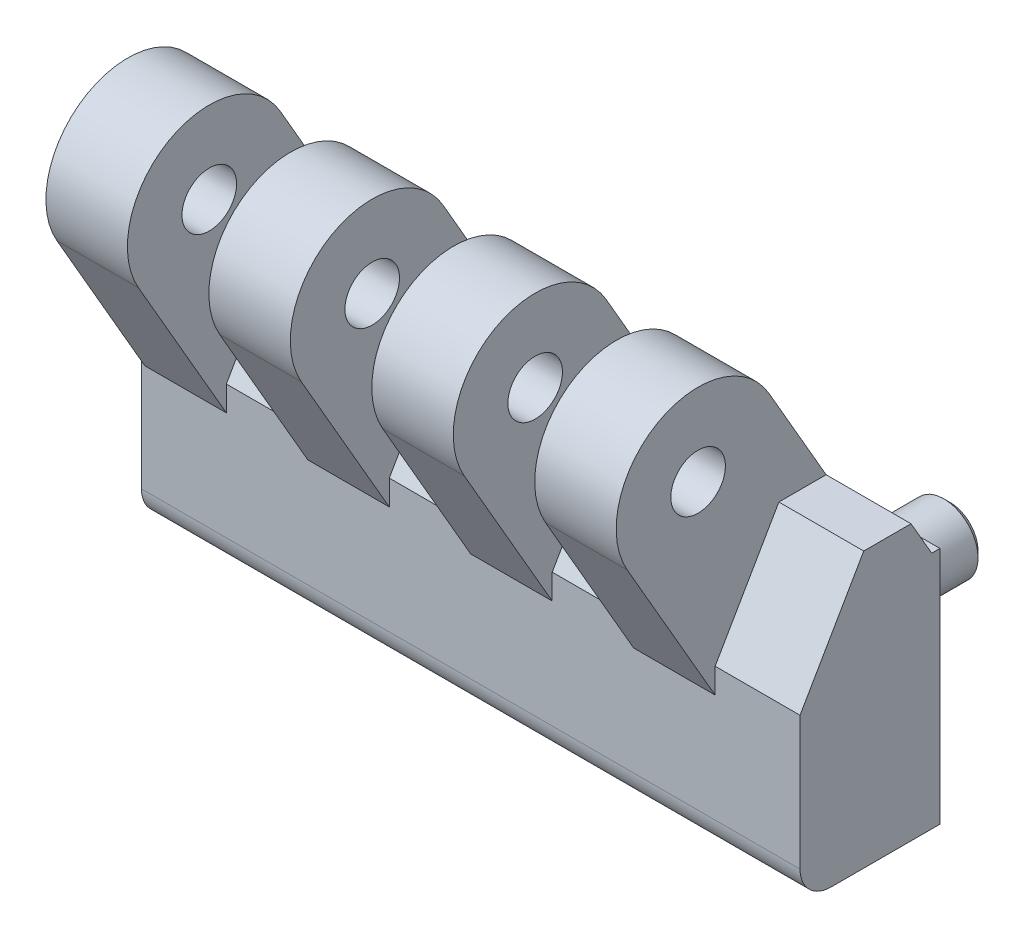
ISO-10303-21;
HEADER;
FILE_DESCRIPTION(('STEP AP214'),'2;1');
FILE_NAME('part.step','',(''),(''),'','','');
FILE_SCHEMA(('AUTOMOTIVE_DESIGN { 1 0 10303 214 1 1 1 1 }'));
ENDSEC;
DATA;
#1=APPLICATION_CONTEXT('core data for automotive mechanical design processes');
#2=APPLICATION_PROTOCOL_DEFINITION('international standard','automotive_design',2000,#1);
#3=PRODUCT_CONTEXT('',#1,'mechanical');
#4=PRODUCT('Part','Part','',(#3));
#5=PRODUCT_RELATED_PRODUCT_CATEGORY('part','',(#4));
#6=PRODUCT_DEFINITION_FORMATION('','',#4);
#7=PRODUCT_DEFINITION_CONTEXT('part definition',#1,'design');
#8=PRODUCT_DEFINITION('design','',#6,#7);
#9=PRODUCT_DEFINITION_SHAPE('','',#8);
#10=(LENGTH_UNIT() NAMED_UNIT(*) SI_UNIT(.MILLI.,.METRE.));
#11=(NAMED_UNIT(*) PLANE_ANGLE_UNIT() SI_UNIT($,.RADIAN.));
#12=(NAMED_UNIT(*) SI_UNIT($,.STERADIAN.) SOLID_ANGLE_UNIT());
#13=UNCERTAINTY_MEASURE_WITH_UNIT(LENGTH_MEASURE(1.E-05),#10,'distance_accuracy_value','');
#14=(GEOMETRIC_REPRESENTATION_CONTEXT(3) GLOBAL_UNCERTAINTY_ASSIGNED_CONTEXT((#13)) GLOBAL_UNIT_ASSIGNED_CONTEXT((#10,
#11,#12)) REPRESENTATION_CONTEXT('',''));
#15=CARTESIAN_POINT('',(0.,0.,0.));
#16=DIRECTION('',(0.,0.,1.));
#17=DIRECTION('',(1.,0.,0.));
#18=AXIS2_PLACEMENT_3D('',#15,#16,#17);
#19=CARTESIAN_POINT('',(-18.5,22.75,4.2361162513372));
#20=DIRECTION('',(0.,1.,0.));
#21=DIRECTION('',(-1.,0.,0.));
#22=AXIS2_PLACEMENT_3D('',#19,#20,#21);
#23=PLANE('',#22);
#24=DIRECTION('',(1.,0.,0.));
#25=VECTOR('',#24,1.);
#26=CARTESIAN_POINT('',(-18.5,22.75,11.164319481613));
#27=LINE('',#26,#25);
#28=CARTESIAN_POINT('',(41.6875,22.75,11.164319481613));
#29=VERTEX_POINT('',#28);
#30=CARTESIAN_POINT('',(53.625,22.75,11.164319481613));
#31=VERTEX_POINT('',#30);
#32=EDGE_CURVE('E471',#29,#31,#27,.T.);
#33=ORIENTED_EDGE('',*,*,#32,.T.);
#34=DIRECTION('',(0.,0.,-1.));
#35=VECTOR('',#34,1.);
#36=CARTESIAN_POINT('',(53.625,22.75,4.2361162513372));
#37=LINE('',#36,#35);
#38=CARTESIAN_POINT('',(53.625,22.75,4.23611625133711));
#39=VERTEX_POINT('',#38);
#40=EDGE_CURVE('E29',#31,#39,#37,.T.);
#41=ORIENTED_EDGE('',*,*,#40,.T.);
#42=DIRECTION('',(1.,0.,0.));
#43=VECTOR('',#42,1.);
#44=CARTESIAN_POINT('',(-18.5,22.75,4.2361162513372));
#45=LINE('',#44,#43);
#46=CARTESIAN_POINT('',(41.6875,22.75,4.23611625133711));
#47=VERTEX_POINT('',#46);
#48=EDGE_CURVE('E232',#47,#39,#45,.T.);
#49=ORIENTED_EDGE('',*,*,#48,.F.);
#50=DIRECTION('',(0.,0.,-1.));
#51=VECTOR('',#50,1.);
#52=CARTESIAN_POINT('',(41.6875,22.75,4.2361162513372));
#53=LINE('',#52,#51);
#54=EDGE_CURVE('E405',#29,#47,#53,.T.);
#55=ORIENTED_EDGE('',*,*,#54,.F.);
#56=EDGE_LOOP('',(#33,#41,#49,#55));
#57=FACE_BOUND('',#56,.T.);
#58=ADVANCED_FACE('F14',(#57),#23,.T.);
#59=CARTESIAN_POINT('',(-18.5,22.75,11.164319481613));
#60=DIRECTION('',(0.,0.499999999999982,0.866025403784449));
#61=DIRECTION('',(0.,-0.866025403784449,0.499999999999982));
#62=AXIS2_PLACEMENT_3D('',#59,#60,#61);
#63=PLANE('',#62);
#64=DIRECTION('',(1.,0.,0.));
#65=VECTOR('',#64,1.);
#66=CARTESIAN_POINT('',(-18.5,6.580127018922,20.5));
#67=LINE('',#66,#65);
#68=CARTESIAN_POINT('',(41.6875,6.580127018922,20.5));
#69=VERTEX_POINT('',#68);
#70=CARTESIAN_POINT('',(53.625,6.580127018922,20.5));
#71=VERTEX_POINT('',#70);
#72=EDGE_CURVE('E465',#69,#71,#67,.T.);
#73=ORIENTED_EDGE('',*,*,#72,.T.);
#74=DIRECTION('',(0.,0.866025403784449,-0.499999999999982));
#75=VECTOR('',#74,1.);
#76=CARTESIAN_POINT('',(53.625,22.75,11.164319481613));
#77=LINE('',#76,#75);
#78=EDGE_CURVE('E502',#71,#31,#77,.T.);
#79=ORIENTED_EDGE('',*,*,#78,.T.);
#80=ORIENTED_EDGE('',*,*,#32,.F.);
#81=DIRECTION('',(0.,0.866025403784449,-0.499999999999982));
#82=VECTOR('',#81,1.);
#83=CARTESIAN_POINT('',(41.6875,22.75,11.164319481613));
#84=LINE('',#83,#82);
#85=EDGE_CURVE('E403',#69,#29,#84,.T.);
#86=ORIENTED_EDGE('',*,*,#85,.F.);
#87=EDGE_LOOP('',(#73,#79,#80,#86));
#88=FACE_BOUND('',#87,.T.);
#89=ADVANCED_FACE('F630',(#88),#63,.T.);
#90=CARTESIAN_POINT('',(-18.5,22.75,11.164319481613));
#91=VERTEX_POINT('',#90);
#92=CARTESIAN_POINT('',(-18.,22.75,11.164319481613));
#93=VERTEX_POINT('',#92);
#94=EDGE_CURVE('E466',#91,#93,#27,.T.);
#95=ORIENTED_EDGE('',*,*,#94,.T.);
#96=DIRECTION('',(0.,0.,-1.));
#97=VECTOR('',#96,1.);
#98=CARTESIAN_POINT('',(-18.,22.75,4.2361162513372));
#99=LINE('',#98,#97);
#100=CARTESIAN_POINT('',(-18.,22.75,4.2361162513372));
#101=VERTEX_POINT('',#100);
#102=EDGE_CURVE('E322',#93,#101,#99,.T.);
#103=ORIENTED_EDGE('',*,*,#102,.T.);
#104=CARTESIAN_POINT('',(-18.5,22.75,4.2361162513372));
#105=VERTEX_POINT('',#104);
#106=EDGE_CURVE('E472',#105,#101,#45,.T.);
#107=ORIENTED_EDGE('',*,*,#106,.F.);
#108=DIRECTION('',(0.,0.,1.));
#109=VECTOR('',#108,1.);
#110=CARTESIAN_POINT('',(-18.5,22.75,4.2361162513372));
#111=LINE('',#110,#109);
#112=EDGE_CURVE('E441',#105,#91,#111,.T.);
#113=ORIENTED_EDGE('',*,*,#112,.T.);
#114=EDGE_LOOP('',(#95,#103,#107,#113));
#115=FACE_BOUND('',#114,.T.);
#116=ADVANCED_FACE('F574',(#115),#23,.T.);
#117=CARTESIAN_POINT('',(-18.5,6.580127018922,20.5));
#118=VERTEX_POINT('',#117);
#119=CARTESIAN_POINT('',(-18.,6.580127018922,20.5));
#120=VERTEX_POINT('',#119);
#121=EDGE_CURVE('E460',#118,#120,#67,.T.);
#122=ORIENTED_EDGE('',*,*,#121,.T.);
#123=DIRECTION('',(0.,0.866025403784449,-0.499999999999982));
#124=VECTOR('',#123,1.);
#125=CARTESIAN_POINT('',(-18.,22.75,11.164319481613));
#126=LINE('',#125,#124);
#127=EDGE_CURVE('E320',#120,#93,#126,.T.);
#128=ORIENTED_EDGE('',*,*,#127,.T.);
#129=ORIENTED_EDGE('',*,*,#94,.F.);
#130=DIRECTION('',(0.,-0.866025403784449,0.499999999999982));
#131=VECTOR('',#130,1.);
#132=CARTESIAN_POINT('',(-18.5,22.75,11.164319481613));
#133=LINE('',#132,#131);
#134=EDGE_CURVE('E444',#91,#118,#133,.T.);
#135=ORIENTED_EDGE('',*,*,#134,.T.);
#136=EDGE_LOOP('',(#122,#128,#129,#135));
#137=FACE_BOUND('',#136,.T.);
#138=ADVANCED_FACE('F638',(#137),#63,.T.);
#139=CARTESIAN_POINT('',(-18.5,6.580127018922,20.5));
#140=DIRECTION('',(0.,0.,1.));
#141=DIRECTION('',(1.,0.,0.));
#142=AXIS2_PLACEMENT_3D('',#139,#140,#141);
#143=PLANE('',#142);
#144=DIRECTION('',(0.,1.,0.));
#145=VECTOR('',#144,1.);
#146=CARTESIAN_POINT('',(65.5625,6.580127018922,20.5));
#147=LINE('',#146,#145);
#148=CARTESIAN_POINT('',(65.5625,2.919872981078,20.5));
#149=VERTEX_POINT('',#148);
#150=CARTESIAN_POINT('',(65.5625,6.580127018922,20.5));
#151=VERTEX_POINT('',#150);
#152=EDGE_CURVE('E278',#149,#151,#147,.T.);
#153=ORIENTED_EDGE('',*,*,#152,.F.);
#154=DIRECTION('',(-1.,0.,0.));
#155=VECTOR('',#154,1.);
#156=CARTESIAN_POINT('',(-18.5,2.919872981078,20.5));
#157=LINE('',#156,#155);
#158=CARTESIAN_POINT('',(53.625,2.919872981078,20.5));
#159=VERTEX_POINT('',#158);
#160=EDGE_CURVE('E506',#149,#159,#157,.T.);
#161=ORIENTED_EDGE('',*,*,#160,.T.);
#162=DIRECTION('',(0.,1.,0.));
#163=VECTOR('',#162,1.);
#164=CARTESIAN_POINT('',(53.625,6.580127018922,20.5));
#165=LINE('',#164,#163);
#166=EDGE_CURVE('E273',#159,#71,#165,.T.);
#167=ORIENTED_EDGE('',*,*,#166,.T.);
#168=ORIENTED_EDGE('',*,*,#72,.F.);
#169=DIRECTION('',(0.,1.,0.));
#170=VECTOR('',#169,1.);
#171=CARTESIAN_POINT('',(41.6875,6.580127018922,20.5));
#172=LINE('',#171,#170);
#173=CARTESIAN_POINT('',(41.6875,2.919872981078,20.5));
#174=VERTEX_POINT('',#173);
#175=EDGE_CURVE('E488',#174,#69,#172,.T.);
#176=ORIENTED_EDGE('',*,*,#175,.F.);
#177=DIRECTION('',(-1.,0.,0.));
#178=VECTOR('',#177,1.);
#179=CARTESIAN_POINT('',(-18.5,2.919872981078,20.5));
#180=LINE('',#179,#178);
#181=CARTESIAN_POINT('',(29.75,2.919872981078,20.5));
#182=VERTEX_POINT('',#181);
#183=EDGE_CURVE('E485',#174,#182,#180,.T.);
#184=ORIENTED_EDGE('',*,*,#183,.T.);
#185=DIRECTION('',(0.,1.,0.));
#186=VECTOR('',#185,1.);
#187=CARTESIAN_POINT('',(29.75,6.580127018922,20.5));
#188=LINE('',#187,#186);
#189=CARTESIAN_POINT('',(29.75,6.580127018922,20.5));
#190=VERTEX_POINT('',#189);
#191=EDGE_CURVE('E482',#182,#190,#188,.T.);
#192=ORIENTED_EDGE('',*,*,#191,.T.);
#193=CARTESIAN_POINT('',(17.8125,6.580127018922,20.5));
#194=VERTEX_POINT('',#193);
#195=EDGE_CURVE('E552',#194,#190,#67,.T.);
#196=ORIENTED_EDGE('',*,*,#195,.F.);
#197=DIRECTION('',(0.,1.,0.));
#198=VECTOR('',#197,1.);
#199=CARTESIAN_POINT('',(17.8125,6.580127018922,20.5));
#200=LINE('',#199,#198);
#201=CARTESIAN_POINT('',(17.8125,2.919872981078,20.5));
#202=VERTEX_POINT('',#201);
#203=EDGE_CURVE('E490',#202,#194,#200,.T.);
#204=ORIENTED_EDGE('',*,*,#203,.F.);
#205=DIRECTION('',(1.,0.,0.));
#206=VECTOR('',#205,1.);
#207=CARTESIAN_POINT('',(-18.5,2.919872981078,20.5));
#208=LINE('',#207,#206);
#209=CARTESIAN_POINT('',(5.875,2.919872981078,20.5));
#210=VERTEX_POINT('',#209);
#211=EDGE_CURVE('E493',#210,#202,#208,.T.);
#212=ORIENTED_EDGE('',*,*,#211,.F.);
#213=DIRECTION('',(0.,1.,0.));
#214=VECTOR('',#213,1.);
#215=CARTESIAN_POINT('',(5.875,6.580127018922,20.5));
#216=LINE('',#215,#214);
#217=CARTESIAN_POINT('',(5.875,6.580127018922,20.5));
#218=VERTEX_POINT('',#217);
#219=EDGE_CURVE('E496',#210,#218,#216,.T.);
#220=ORIENTED_EDGE('',*,*,#219,.T.);
#221=CARTESIAN_POINT('',(-6.0625,6.580127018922,20.5));
#222=VERTEX_POINT('',#221);
#223=EDGE_CURVE('E464',#222,#218,#67,.T.);
#224=ORIENTED_EDGE('',*,*,#223,.F.);
#225=DIRECTION('',(0.,1.,0.));
#226=VECTOR('',#225,1.);
#227=CARTESIAN_POINT('',(-6.0625,6.580127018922,20.5));
#228=LINE('',#227,#226);
#229=CARTESIAN_POINT('',(-6.0625,2.919872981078,20.5));
#230=VERTEX_POINT('',#229);
#231=EDGE_CURVE('E311',#230,#222,#228,.T.);
#232=ORIENTED_EDGE('',*,*,#231,.F.);
#233=DIRECTION('',(1.,0.,0.));
#234=VECTOR('',#233,1.);
#235=CARTESIAN_POINT('',(-18.5,2.919872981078,20.5));
#236=LINE('',#235,#234);
#237=CARTESIAN_POINT('',(-18.,2.919872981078,20.5));
#238=VERTEX_POINT('',#237);
#239=EDGE_CURVE('E499',#238,#230,#236,.T.);
#240=ORIENTED_EDGE('',*,*,#239,.F.);
#241=DIRECTION('',(0.,1.,0.));
#242=VECTOR('',#241,1.);
#243=CARTESIAN_POINT('',(-18.,6.580127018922,20.5));
#244=LINE('',#243,#242);
#245=EDGE_CURVE('E318',#238,#120,#244,.T.);
#246=ORIENTED_EDGE('',*,*,#245,.T.);
#247=ORIENTED_EDGE('',*,*,#121,.F.);
#248=DIRECTION('',(0.,-1.,0.));
#249=VECTOR('',#248,1.);
#250=CARTESIAN_POINT('',(-18.5,6.580127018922,20.5));
#251=LINE('',#250,#249);
#252=CARTESIAN_POINT('',(-18.5,-12.944444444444,20.5));
#253=VERTEX_POINT('',#252);
#254=EDGE_CURVE('E447',#118,#253,#251,.T.);
#255=ORIENTED_EDGE('',*,*,#254,.T.);
#256=DIRECTION('',(1.,0.,0.));
#257=VECTOR('',#256,1.);
#258=CARTESIAN_POINT('',(-18.5,-12.944444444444,20.5));
#259=LINE('',#258,#257);
#260=CARTESIAN_POINT('',(78.,-12.944444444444,20.5));
#261=VERTEX_POINT('',#260);
#262=EDGE_CURVE('E457',#253,#261,#259,.T.);
#263=ORIENTED_EDGE('',*,*,#262,.T.);
#264=DIRECTION('',(0.,-1.,0.));
#265=VECTOR('',#264,1.);
#266=CARTESIAN_POINT('',(78.,6.580127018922,20.5));
#267=LINE('',#266,#265);
#268=CARTESIAN_POINT('',(78.,6.580127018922,20.5));
#269=VERTEX_POINT('',#268);
#270=EDGE_CURVE('E423',#269,#261,#267,.T.);
#271=ORIENTED_EDGE('',*,*,#270,.F.);
#272=EDGE_CURVE('E459',#151,#269,#67,.T.);
#273=ORIENTED_EDGE('',*,*,#272,.F.);
#274=EDGE_LOOP('',(#153,#161,#167,#168,#176,#184,#192,#196,#204,#212,#220,#224,#232,#240,#246,
#247,#255,#263,#271,#273));
#275=FACE_BOUND('',#274,.T.);
#276=ADVANCED_FACE('F563',(#275),#143,.T.);
#277=DIRECTION('',(0.,0.,-1.));
#278=VECTOR('',#277,1.);
#279=CARTESIAN_POINT('',(-6.0625,22.75,4.2361162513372));
#280=LINE('',#279,#278);
#281=CARTESIAN_POINT('',(-6.0625,22.75,11.164319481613));
#282=VERTEX_POINT('',#281);
#283=CARTESIAN_POINT('',(-6.0625,22.75,4.2361162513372));
#284=VERTEX_POINT('',#283);
#285=EDGE_CURVE('E37',#282,#284,#280,.T.);
#286=ORIENTED_EDGE('',*,*,#285,.F.);
#287=CARTESIAN_POINT('',(5.875,22.75,11.164319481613));
#288=VERTEX_POINT('',#287);
#289=EDGE_CURVE('E470',#282,#288,#27,.T.);
#290=ORIENTED_EDGE('',*,*,#289,.T.);
#291=DIRECTION('',(0.,0.,-1.));
#292=VECTOR('',#291,1.);
#293=CARTESIAN_POINT('',(5.875,22.75,4.2361162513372));
#294=LINE('',#293,#292);
#295=CARTESIAN_POINT('',(5.875,22.75,4.2361162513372));
#296=VERTEX_POINT('',#295);
#297=EDGE_CURVE('E364',#288,#296,#294,.T.);
#298=ORIENTED_EDGE('',*,*,#297,.T.);
#299=EDGE_CURVE('E476',#284,#296,#45,.T.);
#300=ORIENTED_EDGE('',*,*,#299,.F.);
#301=EDGE_LOOP('',(#286,#290,#298,#300));
#302=FACE_BOUND('',#301,.T.);
#303=ADVANCED_FACE('F603',(#302),#23,.T.);
#304=DIRECTION('',(0.,0.866025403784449,-0.499999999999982));
#305=VECTOR('',#304,1.);
#306=CARTESIAN_POINT('',(-6.0625,22.75,11.164319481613));
#307=LINE('',#306,#305);
#308=EDGE_CURVE('E314',#222,#282,#307,.T.);
#309=ORIENTED_EDGE('',*,*,#308,.F.);
#310=ORIENTED_EDGE('',*,*,#223,.T.);
#311=DIRECTION('',(0.,0.866025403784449,-0.499999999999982));
#312=VECTOR('',#311,1.);
#313=CARTESIAN_POINT('',(5.875,22.75,11.164319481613));
#314=LINE('',#313,#312);
#315=EDGE_CURVE('E361',#218,#288,#314,.T.);
#316=ORIENTED_EDGE('',*,*,#315,.T.);
#317=ORIENTED_EDGE('',*,*,#289,.F.);
#318=EDGE_LOOP('',(#309,#310,#316,#317));
#319=FACE_BOUND('',#318,.T.);
#320=ADVANCED_FACE('F594',(#319),#63,.T.);
#321=DIRECTION('',(0.,0.,-1.));
#322=VECTOR('',#321,1.);
#323=CARTESIAN_POINT('',(17.8125,22.75,4.2361162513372));
#324=LINE('',#323,#322);
#325=CARTESIAN_POINT('',(17.8125,22.75,11.164319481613));
#326=VERTEX_POINT('',#325);
#327=CARTESIAN_POINT('',(17.8125,22.75,4.2361162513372));
#328=VERTEX_POINT('',#327);
#329=EDGE_CURVE('E358',#326,#328,#324,.T.);
#330=ORIENTED_EDGE('',*,*,#329,.F.);
#331=CARTESIAN_POINT('',(29.75,22.75,11.164319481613));
#332=VERTEX_POINT('',#331);
#333=EDGE_CURVE('E538',#326,#332,#27,.T.);
#334=ORIENTED_EDGE('',*,*,#333,.T.);
#335=DIRECTION('',(0.,0.,-1.));
#336=VECTOR('',#335,1.);
#337=CARTESIAN_POINT('',(29.75,22.75,4.2361162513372));
#338=LINE('',#337,#336);
#339=CARTESIAN_POINT('',(29.75,22.75,4.23611625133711));
#340=VERTEX_POINT('',#339);
#341=EDGE_CURVE('E400',#332,#340,#338,.T.);
#342=ORIENTED_EDGE('',*,*,#341,.T.);
#343=EDGE_CURVE('E604',#328,#340,#45,.T.);
#344=ORIENTED_EDGE('',*,*,#343,.F.);
#345=EDGE_LOOP('',(#330,#334,#342,#344));
#346=FACE_BOUND('',#345,.T.);
#347=ADVANCED_FACE('F542',(#346),#23,.T.);
#348=DIRECTION('',(0.,0.866025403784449,-0.499999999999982));
#349=VECTOR('',#348,1.);
#350=CARTESIAN_POINT('',(17.8125,22.75,11.164319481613));
#351=LINE('',#350,#349);
#352=EDGE_CURVE('E355',#194,#326,#351,.T.);
#353=ORIENTED_EDGE('',*,*,#352,.F.);
#354=ORIENTED_EDGE('',*,*,#195,.T.);
#355=DIRECTION('',(0.,0.866025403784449,-0.499999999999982));
#356=VECTOR('',#355,1.);
#357=CARTESIAN_POINT('',(29.75,22.75,11.164319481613));
#358=LINE('',#357,#356);
#359=EDGE_CURVE('E397',#190,#332,#358,.T.);
#360=ORIENTED_EDGE('',*,*,#359,.T.);
#361=ORIENTED_EDGE('',*,*,#333,.F.);
#362=EDGE_LOOP('',(#353,#354,#360,#361));
#363=FACE_BOUND('',#362,.T.);
#364=ADVANCED_FACE('F551',(#363),#63,.T.);
#365=CARTESIAN_POINT('',(-18.5,-17.5,15.944444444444));
#366=DIRECTION('',(0.,-1.,0.));
#367=DIRECTION('',(1.,0.,0.));
#368=AXIS2_PLACEMENT_3D('',#365,#366,#367);
#369=PLANE('',#368);
#370=DIRECTION('',(1.,0.,0.));
#371=VECTOR('',#370,1.);
#372=CARTESIAN_POINT('',(-18.5,-17.5,0.));
#373=LINE('',#372,#371);
#374=CARTESIAN_POINT('',(-18.5,-17.5,0.));
#375=VERTEX_POINT('',#374);
#376=CARTESIAN_POINT('',(78.,-17.5,0.));
#377=VERTEX_POINT('',#376);
#378=EDGE_CURVE('E480',#375,#377,#373,.T.);
#379=ORIENTED_EDGE('',*,*,#378,.T.);
#380=DIRECTION('',(0.,0.,-1.));
#381=VECTOR('',#380,1.);
#382=CARTESIAN_POINT('',(78.,-17.5,15.944444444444));
#383=LINE('',#382,#381);
#384=CARTESIAN_POINT('',(78.,-17.5,15.944444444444));
#385=VERTEX_POINT('',#384);
#386=EDGE_CURVE('E407',#385,#377,#383,.T.);
#387=ORIENTED_EDGE('',*,*,#386,.F.);
#388=DIRECTION('',(1.,0.,0.));
#389=VECTOR('',#388,1.);
#390=CARTESIAN_POINT('',(-18.5,-17.5,15.944444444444));
#391=LINE('',#390,#389);
#392=CARTESIAN_POINT('',(-18.5,-17.5,15.944444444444));
#393=VERTEX_POINT('',#392);
#394=EDGE_CURVE('E453',#393,#385,#391,.T.);
#395=ORIENTED_EDGE('',*,*,#394,.F.);
#396=DIRECTION('',(0.,0.,-1.));
#397=VECTOR('',#396,1.);
#398=CARTESIAN_POINT('',(-18.5,-17.5,15.944444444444));
#399=LINE('',#398,#397);
#400=EDGE_CURVE('E429',#393,#375,#399,.T.);
#401=ORIENTED_EDGE('',*,*,#400,.T.);
#402=EDGE_LOOP('',(#379,#387,#395,#401));
#403=FACE_BOUND('',#402,.T.);
#404=ADVANCED_FACE('F16',(#403),#369,.T.);
#405=CARTESIAN_POINT('',(-18.5,-17.5,0.));
#406=DIRECTION('',(0.,0.,-1.));
#407=DIRECTION('',(-1.,0.,0.));
#408=AXIS2_PLACEMENT_3D('',#405,#406,#407);
#409=PLANE('',#408);
#410=CARTESIAN_POINT('',(0.,0.,0.));
#411=DIRECTION('',(0.,0.,-1.));
#412=DIRECTION('',(-1.,0.,0.));
#413=AXIS2_PLACEMENT_3D('',#410,#411,#412);
#414=CIRCLE('',#413,5.);
#415=CARTESIAN_POINT('',(-5.,0.,0.));
#416=VERTEX_POINT('',#415);
#417=EDGE_CURVE('E9',#416,#416,#414,.T.);
#418=ORIENTED_EDGE('',*,*,#417,.F.);
#419=EDGE_LOOP('',(#418));
#420=FACE_BOUND('',#419,.T.);
#421=CARTESIAN_POINT('',(59.5,0.,0.));
#422=DIRECTION('',(0.,0.,-1.));
#423=DIRECTION('',(-1.,0.,0.));
#424=AXIS2_PLACEMENT_3D('',#421,#422,#423);
#425=CIRCLE('',#424,5.);
#426=CARTESIAN_POINT('',(54.5,0.,0.));
#427=VERTEX_POINT('',#426);
#428=EDGE_CURVE('E22',#427,#427,#425,.T.);
#429=ORIENTED_EDGE('',*,*,#428,.F.);
#430=EDGE_LOOP('',(#429));
#431=FACE_BOUND('',#430,.T.);
#432=DIRECTION('',(1.,0.,0.));
#433=VECTOR('',#432,1.);
#434=CARTESIAN_POINT('',(-18.5,17.5,0.));
#435=LINE('',#434,#433);
#436=CARTESIAN_POINT('',(-18.5,17.5,0.));
#437=VERTEX_POINT('',#436);
#438=CARTESIAN_POINT('',(78.,17.5,0.));
#439=VERTEX_POINT('',#438);
#440=EDGE_CURVE('E478',#437,#439,#435,.T.);
#441=ORIENTED_EDGE('',*,*,#440,.T.);
#442=DIRECTION('',(0.,1.,0.));
#443=VECTOR('',#442,1.);
#444=CARTESIAN_POINT('',(78.,-17.5,0.));
#445=LINE('',#444,#443);
#446=EDGE_CURVE('E408',#377,#439,#445,.T.);
#447=ORIENTED_EDGE('',*,*,#446,.F.);
#448=ORIENTED_EDGE('',*,*,#378,.F.);
#449=DIRECTION('',(0.,1.,0.));
#450=VECTOR('',#449,1.);
#451=CARTESIAN_POINT('',(-18.5,-17.5,0.));
#452=LINE('',#451,#450);
#453=EDGE_CURVE('E432',#375,#437,#452,.T.);
#454=ORIENTED_EDGE('',*,*,#453,.T.);
#455=EDGE_LOOP('',(#441,#447,#448,#454));
#456=FACE_BOUND('',#455,.T.);
#457=ADVANCED_FACE('F513',(#420,#431,#456),#409,.T.);
#458=CARTESIAN_POINT('',(-18.5,17.5,0.));
#459=DIRECTION('',(0.,1.,0.));
#460=DIRECTION('',(-1.,0.,0.));
#461=AXIS2_PLACEMENT_3D('',#458,#459,#460);
#462=PLANE('',#461);
#463=DIRECTION('',(1.,0.,0.));
#464=VECTOR('',#463,1.);
#465=CARTESIAN_POINT('',(-18.5,17.5,1.2050273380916));
#466=LINE('',#465,#464);
#467=CARTESIAN_POINT('',(-18.5,17.5,1.2050273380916));
#468=VERTEX_POINT('',#467);
#469=CARTESIAN_POINT('',(78.,17.5,1.2050273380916));
#470=VERTEX_POINT('',#469);
#471=EDGE_CURVE('E475',#468,#470,#466,.T.);
#472=ORIENTED_EDGE('',*,*,#471,.T.);
#473=DIRECTION('',(0.,0.,1.));
#474=VECTOR('',#473,1.);
#475=CARTESIAN_POINT('',(78.,17.5,0.));
#476=LINE('',#475,#474);
#477=EDGE_CURVE('E411',#439,#470,#476,.T.);
#478=ORIENTED_EDGE('',*,*,#477,.F.);
#479=ORIENTED_EDGE('',*,*,#440,.F.);
#480=DIRECTION('',(0.,0.,1.));
#481=VECTOR('',#480,1.);
#482=CARTESIAN_POINT('',(-18.5,17.5,0.));
#483=LINE('',#482,#481);
#484=EDGE_CURVE('E435',#437,#468,#483,.T.);
#485=ORIENTED_EDGE('',*,*,#484,.T.);
#486=EDGE_LOOP('',(#472,#478,#479,#485));
#487=FACE_BOUND('',#486,.T.);
#488=ADVANCED_FACE('F516',(#487),#462,.T.);
#489=CARTESIAN_POINT('',(-18.5,17.5,1.2050273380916));
#490=DIRECTION('',(0.,0.500000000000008,-0.866025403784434));
#491=DIRECTION('',(0.,0.866025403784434,0.500000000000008));
#492=AXIS2_PLACEMENT_3D('',#489,#490,#491);
#493=PLANE('',#492);
#494=DIRECTION('',(0.,0.866025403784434,0.500000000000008));
#495=VECTOR('',#494,1.);
#496=CARTESIAN_POINT('',(78.,17.5,1.2050273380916));
#497=LINE('',#496,#495);
#498=CARTESIAN_POINT('',(78.,22.75,4.2361162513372));
#499=VERTEX_POINT('',#498);
#500=EDGE_CURVE('E414',#470,#499,#497,.T.);
#501=ORIENTED_EDGE('',*,*,#500,.F.);
#502=ORIENTED_EDGE('',*,*,#471,.F.);
#503=DIRECTION('',(0.,0.866025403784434,0.500000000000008));
#504=VECTOR('',#503,1.);
#505=CARTESIAN_POINT('',(-18.5,17.5,1.2050273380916));
#506=LINE('',#505,#504);
#507=EDGE_CURVE('E438',#468,#105,#506,.T.);
#508=ORIENTED_EDGE('',*,*,#507,.T.);
#509=ORIENTED_EDGE('',*,*,#106,.T.);
#510=DIRECTION('',(0.,0.866025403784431,0.500000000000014));
#511=VECTOR('',#510,1.);
#512=CARTESIAN_POINT('',(-18.,17.144882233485,1.));
#513=LINE('',#512,#511);
#514=CARTESIAN_POINT('',(-18.,37.25,12.607695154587));
#515=VERTEX_POINT('',#514);
#516=EDGE_CURVE('E296',#101,#515,#513,.T.);
#517=ORIENTED_EDGE('',*,*,#516,.T.);
#518=DIRECTION('',(1.,0.,0.));
#519=VECTOR('',#518,1.);
#520=CARTESIAN_POINT('',(-18.,37.25,12.607695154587));
#521=LINE('',#520,#519);
#522=CARTESIAN_POINT('',(-6.0625,37.25,12.607695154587));
#523=VERTEX_POINT('',#522);
#524=EDGE_CURVE('E308',#515,#523,#521,.T.);
#525=ORIENTED_EDGE('',*,*,#524,.T.);
#526=DIRECTION('',(0.,0.866025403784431,0.500000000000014));
#527=VECTOR('',#526,1.);
#528=CARTESIAN_POINT('',(-6.0625,17.144882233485,1.));
#529=LINE('',#528,#527);
#530=EDGE_CURVE('E281',#284,#523,#529,.T.);
#531=ORIENTED_EDGE('',*,*,#530,.F.);
#532=ORIENTED_EDGE('',*,*,#299,.T.);
#533=DIRECTION('',(0.,0.866025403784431,0.500000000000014));
#534=VECTOR('',#533,1.);
#535=CARTESIAN_POINT('',(5.875,17.144882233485,1.));
#536=LINE('',#535,#534);
#537=CARTESIAN_POINT('',(5.875,37.25,12.607695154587));
#538=VERTEX_POINT('',#537);
#539=EDGE_CURVE('E340',#296,#538,#536,.T.);
#540=ORIENTED_EDGE('',*,*,#539,.T.);
#541=DIRECTION('',(1.,0.,0.));
#542=VECTOR('',#541,1.);
#543=CARTESIAN_POINT('',(5.875,37.25,12.607695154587));
#544=LINE('',#543,#542);
#545=CARTESIAN_POINT('',(17.8125,37.25,12.607695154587));
#546=VERTEX_POINT('',#545);
#547=EDGE_CURVE('E352',#538,#546,#544,.T.);
#548=ORIENTED_EDGE('',*,*,#547,.T.);
#549=DIRECTION('',(0.,0.866025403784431,0.500000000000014));
#550=VECTOR('',#549,1.);
#551=CARTESIAN_POINT('',(17.8125,17.144882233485,1.));
#552=LINE('',#551,#550);
#553=EDGE_CURVE('E325',#328,#546,#552,.T.);
#554=ORIENTED_EDGE('',*,*,#553,.F.);
#555=ORIENTED_EDGE('',*,*,#343,.T.);
#556=DIRECTION('',(0.,0.866025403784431,0.500000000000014));
#557=VECTOR('',#556,1.);
#558=CARTESIAN_POINT('',(29.75,17.144882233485,1.));
#559=LINE('',#558,#557);
#560=CARTESIAN_POINT('',(29.75,37.25,12.607695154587));
#561=VERTEX_POINT('',#560);
#562=EDGE_CURVE('E368',#340,#561,#559,.T.);
#563=ORIENTED_EDGE('',*,*,#562,.T.);
#564=DIRECTION('',(-1.,0.,0.));
#565=VECTOR('',#564,1.);
#566=CARTESIAN_POINT('',(41.6875,37.25,12.607695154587));
#567=LINE('',#566,#565);
#568=CARTESIAN_POINT('',(41.6875,37.25,12.607695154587));
#569=VERTEX_POINT('',#568);
#570=EDGE_CURVE('E394',#569,#561,#567,.T.);
#571=ORIENTED_EDGE('',*,*,#570,.F.);
#572=DIRECTION('',(0.,0.866025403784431,0.500000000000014));
#573=VECTOR('',#572,1.);
#574=CARTESIAN_POINT('',(41.6875,17.144882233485,1.));
#575=LINE('',#574,#573);
#576=EDGE_CURVE('E382',#47,#569,#575,.T.);
#577=ORIENTED_EDGE('',*,*,#576,.F.);
#578=ORIENTED_EDGE('',*,*,#48,.T.);
#579=DIRECTION('',(0.,0.866025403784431,0.500000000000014));
#580=VECTOR('',#579,1.);
#581=CARTESIAN_POINT('',(53.625,17.144882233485,1.));
#582=LINE('',#581,#580);
#583=CARTESIAN_POINT('',(53.625,37.25,12.607695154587));
#584=VERTEX_POINT('',#583);
#585=EDGE_CURVE('E223',#39,#584,#582,.T.);
#586=ORIENTED_EDGE('',*,*,#585,.T.);
#587=DIRECTION('',(-1.,0.,0.));
#588=VECTOR('',#587,1.);
#589=CARTESIAN_POINT('',(65.5625,37.25,12.607695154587));
#590=LINE('',#589,#588);
#591=CARTESIAN_POINT('',(65.5625,37.25,12.607695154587));
#592=VERTEX_POINT('',#591);
#593=EDGE_CURVE('E228',#592,#584,#590,.T.);
#594=ORIENTED_EDGE('',*,*,#593,.F.);
#595=DIRECTION('',(0.,0.866025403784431,0.500000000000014));
#596=VECTOR('',#595,1.);
#597=CARTESIAN_POINT('',(65.5625,17.144882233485,1.));
#598=LINE('',#597,#596);
#599=CARTESIAN_POINT('',(65.5625,22.75,4.23611625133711));
#600=VERTEX_POINT('',#599);
#601=EDGE_CURVE('E263',#600,#592,#598,.T.);
#602=ORIENTED_EDGE('',*,*,#601,.F.);
#603=EDGE_CURVE('E469',#600,#499,#45,.T.);
#604=ORIENTED_EDGE('',*,*,#603,.T.);
#605=EDGE_LOOP('',(#501,#502,#508,#509,#517,#525,#531,#532,#540,#548,#554,#555,#563,#571,#577,
#578,#586,#594,#602,#604));
#606=FACE_BOUND('',#605,.T.);
#607=ADVANCED_FACE('F226',(#606),#493,.T.);
#608=DIRECTION('',(0.,0.,-1.));
#609=VECTOR('',#608,1.);
#610=CARTESIAN_POINT('',(65.5625,22.75,4.2361162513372));
#611=LINE('',#610,#609);
#612=CARTESIAN_POINT('',(65.5625,22.75,11.164319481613));
#613=VERTEX_POINT('',#612);
#614=EDGE_CURVE('E276',#613,#600,#611,.T.);
#615=ORIENTED_EDGE('',*,*,#614,.F.);
#616=CARTESIAN_POINT('',(78.,22.75,11.164319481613));
#617=VERTEX_POINT('',#616);
#618=EDGE_CURVE('E463',#613,#617,#27,.T.);
#619=ORIENTED_EDGE('',*,*,#618,.T.);
#620=DIRECTION('',(0.,0.,1.));
#621=VECTOR('',#620,1.);
#622=CARTESIAN_POINT('',(78.,22.75,4.2361162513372));
#623=LINE('',#622,#621);
#624=EDGE_CURVE('E417',#499,#617,#623,.T.);
#625=ORIENTED_EDGE('',*,*,#624,.F.);
#626=ORIENTED_EDGE('',*,*,#603,.F.);
#627=EDGE_LOOP('',(#615,#619,#625,#626));
#628=FACE_BOUND('',#627,.T.);
#629=ADVANCED_FACE('F533',(#628),#23,.T.);
#630=DIRECTION('',(0.,0.866025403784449,-0.499999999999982));
#631=VECTOR('',#630,1.);
#632=CARTESIAN_POINT('',(65.5625,22.75,11.164319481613));
#633=LINE('',#632,#631);
#634=EDGE_CURVE('E504',#151,#613,#633,.T.);
#635=ORIENTED_EDGE('',*,*,#634,.F.);
#636=ORIENTED_EDGE('',*,*,#272,.T.);
#637=DIRECTION('',(0.,-0.866025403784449,0.499999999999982));
#638=VECTOR('',#637,1.);
#639=CARTESIAN_POINT('',(78.,22.75,11.164319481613));
#640=LINE('',#639,#638);
#641=EDGE_CURVE('E420',#617,#269,#640,.T.);
#642=ORIENTED_EDGE('',*,*,#641,.F.);
#643=ORIENTED_EDGE('',*,*,#618,.F.);
#644=EDGE_LOOP('',(#635,#636,#642,#643));
#645=FACE_BOUND('',#644,.T.);
#646=ADVANCED_FACE('F559',(#645),#63,.T.);
#647=CARTESIAN_POINT('',(-18.5,-12.944444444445,15.944444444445));
#648=DIRECTION('',(1.,0.,0.));
#649=DIRECTION('',(0.,1.,0.));
#650=AXIS2_PLACEMENT_3D('',#647,#648,#649);
#651=CYLINDRICAL_SURFACE('',#650,4.55555555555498);
#652=ORIENTED_EDGE('',*,*,#394,.T.);
#653=CARTESIAN_POINT('',(78.,-12.944444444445,15.944444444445));
#654=DIRECTION('',(1.,0.,0.));
#655=DIRECTION('',(0.,1.,0.));
#656=AXIS2_PLACEMENT_3D('',#653,#654,#655);
#657=CIRCLE('',#656,4.55555555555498);
#658=EDGE_CURVE('E426',#261,#385,#657,.T.);
#659=ORIENTED_EDGE('',*,*,#658,.F.);
#660=ORIENTED_EDGE('',*,*,#262,.F.);
#661=CARTESIAN_POINT('',(-18.5,-12.944444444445,15.944444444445));
#662=DIRECTION('',(1.,0.,0.));
#663=DIRECTION('',(0.,1.,0.));
#664=AXIS2_PLACEMENT_3D('',#661,#662,#663);
#665=CIRCLE('',#664,4.55555555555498);
#666=EDGE_CURVE('E450',#253,#393,#665,.T.);
#667=ORIENTED_EDGE('',*,*,#666,.T.);
#668=EDGE_LOOP('',(#652,#659,#660,#667));
#669=FACE_BOUND('',#668,.T.);
#670=ADVANCED_FACE('F567',(#669),#651,.T.);
#671=CARTESIAN_POINT('',(-18.5,-12.944444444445,15.944444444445));
#672=DIRECTION('',(1.,0.,0.));
#673=DIRECTION('',(0.,1.,0.));
#674=AXIS2_PLACEMENT_3D('',#671,#672,#673);
#675=PLANE('',#674);
#676=ORIENTED_EDGE('',*,*,#400,.F.);
#677=ORIENTED_EDGE('',*,*,#666,.F.);
#678=ORIENTED_EDGE('',*,*,#254,.F.);
#679=ORIENTED_EDGE('',*,*,#134,.F.);
#680=ORIENTED_EDGE('',*,*,#112,.F.);
#681=ORIENTED_EDGE('',*,*,#507,.F.);
#682=ORIENTED_EDGE('',*,*,#484,.F.);
#683=ORIENTED_EDGE('',*,*,#453,.F.);
#684=EDGE_LOOP('',(#676,#677,#678,#679,#680,#681,#682,#683));
#685=FACE_BOUND('',#684,.T.);
#686=ADVANCED_FACE('F571',(#685),#675,.F.);
#687=CARTESIAN_POINT('',(78.,-12.944444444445,15.944444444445));
#688=DIRECTION('',(1.,0.,0.));
#689=DIRECTION('',(0.,1.,0.));
#690=AXIS2_PLACEMENT_3D('',#687,#688,#689);
#691=PLANE('',#690);
#692=ORIENTED_EDGE('',*,*,#386,.T.);
#693=ORIENTED_EDGE('',*,*,#446,.T.);
#694=ORIENTED_EDGE('',*,*,#477,.T.);
#695=ORIENTED_EDGE('',*,*,#500,.T.);
#696=ORIENTED_EDGE('',*,*,#624,.T.);
#697=ORIENTED_EDGE('',*,*,#641,.T.);
#698=ORIENTED_EDGE('',*,*,#270,.T.);
#699=ORIENTED_EDGE('',*,*,#658,.T.);
#700=EDGE_LOOP('',(#692,#693,#694,#695,#696,#697,#698,#699));
#701=FACE_BOUND('',#700,.T.);
#702=ADVANCED_FACE('F524',(#701),#691,.T.);
#703=CARTESIAN_POINT('',(41.6875,25.25,33.392304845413));
#704=DIRECTION('',(0.,0.5,-0.866025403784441));
#705=DIRECTION('',(0.,0.866025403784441,0.5));
#706=AXIS2_PLACEMENT_3D('',#703,#704,#705);
#707=PLANE('',#706);
#708=ORIENTED_EDGE('',*,*,#183,.F.);
#709=DIRECTION('',(0.,-0.866025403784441,-0.5));
#710=VECTOR('',#709,1.);
#711=CARTESIAN_POINT('',(41.6875,25.25,33.392304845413));
#712=LINE('',#711,#710);
#713=CARTESIAN_POINT('',(41.6875,25.25,33.392304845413));
#714=VERTEX_POINT('',#713);
#715=EDGE_CURVE('E381',#714,#174,#712,.T.);
#716=ORIENTED_EDGE('',*,*,#715,.F.);
#717=DIRECTION('',(-1.,0.,0.));
#718=VECTOR('',#717,1.);
#719=CARTESIAN_POINT('',(41.6875,25.25,33.392304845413));
#720=LINE('',#719,#718);
#721=CARTESIAN_POINT('',(29.75,25.25,33.392304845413));
#722=VERTEX_POINT('',#721);
#723=EDGE_CURVE('E391',#714,#722,#720,.T.);
#724=ORIENTED_EDGE('',*,*,#723,.T.);
#725=DIRECTION('',(0.,-0.866025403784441,-0.5));
#726=VECTOR('',#725,1.);
#727=CARTESIAN_POINT('',(29.75,25.25,33.392304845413));
#728=LINE('',#727,#726);
#729=EDGE_CURVE('E367',#722,#182,#728,.T.);
#730=ORIENTED_EDGE('',*,*,#729,.T.);
#731=EDGE_LOOP('',(#708,#716,#724,#730));
#732=FACE_BOUND('',#731,.T.);
#733=ADVANCED_FACE('F671',(#732),#707,.F.);
#734=CARTESIAN_POINT('',(41.6875,31.25,23.));
#735=DIRECTION('',(-1.,0.,0.));
#736=DIRECTION('',(0.,-1.,0.));
#737=AXIS2_PLACEMENT_3D('',#734,#735,#736);
#738=CYLINDRICAL_SURFACE('',#737,4.);
#739=CARTESIAN_POINT('',(41.6875,31.25,23.));
#740=DIRECTION('',(1.,0.,0.));
#741=DIRECTION('',(0.,1.,0.));
#742=AXIS2_PLACEMENT_3D('',#739,#740,#741);
#743=CIRCLE('',#742,4.);
#744=CARTESIAN_POINT('',(41.6875,35.25,23.));
#745=VERTEX_POINT('',#744);
#746=EDGE_CURVE('E386',#745,#745,#743,.T.);
#747=ORIENTED_EDGE('',*,*,#746,.T.);
#748=EDGE_LOOP('',(#747));
#749=FACE_BOUND('',#748,.T.);
#750=CARTESIAN_POINT('',(29.75,31.25,23.));
#751=DIRECTION('',(1.,0.,0.));
#752=DIRECTION('',(0.,1.,0.));
#753=AXIS2_PLACEMENT_3D('',#750,#751,#752);
#754=CIRCLE('',#753,4.);
#755=CARTESIAN_POINT('',(29.75,35.25,23.));
#756=VERTEX_POINT('',#755);
#757=EDGE_CURVE('E374',#756,#756,#754,.T.);
#758=ORIENTED_EDGE('',*,*,#757,.F.);
#759=EDGE_LOOP('',(#758));
#760=FACE_BOUND('',#759,.T.);
#761=ADVANCED_FACE('F674',(#749,#760),#738,.F.);
#762=CARTESIAN_POINT('',(41.6875,31.25,23.));
#763=DIRECTION('',(-1.,0.,0.));
#764=DIRECTION('',(0.,-1.,0.));
#765=AXIS2_PLACEMENT_3D('',#762,#763,#764);
#766=CYLINDRICAL_SURFACE('',#765,11.9999999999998);
#767=CARTESIAN_POINT('',(29.75,31.25,23.));
#768=DIRECTION('',(1.,0.,0.));
#769=DIRECTION('',(0.,-1.,0.));
#770=AXIS2_PLACEMENT_3D('',#767,#768,#769);
#771=CIRCLE('',#770,11.9999999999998);
#772=EDGE_CURVE('E371',#561,#722,#771,.T.);
#773=ORIENTED_EDGE('',*,*,#772,.T.);
#774=ORIENTED_EDGE('',*,*,#723,.F.);
#775=CARTESIAN_POINT('',(41.6875,31.25,23.));
#776=DIRECTION('',(1.,0.,0.));
#777=DIRECTION('',(0.,-1.,0.));
#778=AXIS2_PLACEMENT_3D('',#775,#776,#777);
#779=CIRCLE('',#778,11.9999999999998);
#780=EDGE_CURVE('E384',#569,#714,#779,.T.);
#781=ORIENTED_EDGE('',*,*,#780,.F.);
#782=ORIENTED_EDGE('',*,*,#570,.T.);
#783=EDGE_LOOP('',(#773,#774,#781,#782));
#784=FACE_BOUND('',#783,.T.);
#785=ADVANCED_FACE('F676',(#784),#766,.T.);
#786=CARTESIAN_POINT('',(41.6875,31.25,23.));
#787=DIRECTION('',(1.,0.,0.));
#788=DIRECTION('',(0.,1.,0.));
#789=AXIS2_PLACEMENT_3D('',#786,#787,#788);
#790=PLANE('',#789);
#791=ORIENTED_EDGE('',*,*,#746,.F.);
#792=EDGE_LOOP('',(#791));
#793=FACE_BOUND('',#792,.T.);
#794=ORIENTED_EDGE('',*,*,#85,.T.);
#795=ORIENTED_EDGE('',*,*,#54,.T.);
#796=ORIENTED_EDGE('',*,*,#576,.T.);
#797=ORIENTED_EDGE('',*,*,#780,.T.);
#798=ORIENTED_EDGE('',*,*,#715,.T.);
#799=ORIENTED_EDGE('',*,*,#175,.T.);
#800=EDGE_LOOP('',(#794,#795,#796,#797,#798,#799));
#801=FACE_BOUND('',#800,.T.);
#802=ADVANCED_FACE('F679',(#793,#801),#790,.T.);
#803=CARTESIAN_POINT('',(29.75,31.25,23.));
#804=DIRECTION('',(1.,0.,0.));
#805=DIRECTION('',(0.,1.,0.));
#806=AXIS2_PLACEMENT_3D('',#803,#804,#805);
#807=PLANE('',#806);
#808=ORIENTED_EDGE('',*,*,#341,.F.);
#809=ORIENTED_EDGE('',*,*,#359,.F.);
#810=ORIENTED_EDGE('',*,*,#191,.F.);
#811=ORIENTED_EDGE('',*,*,#729,.F.);
#812=ORIENTED_EDGE('',*,*,#772,.F.);
#813=ORIENTED_EDGE('',*,*,#562,.F.);
#814=EDGE_LOOP('',(#808,#809,#810,#811,#812,#813));
#815=FACE_BOUND('',#814,.T.);
#816=ORIENTED_EDGE('',*,*,#757,.T.);
#817=EDGE_LOOP('',(#816));
#818=FACE_BOUND('',#817,.T.);
#819=ADVANCED_FACE('F548',(#815,#818),#807,.F.);
#820=CARTESIAN_POINT('',(5.875,25.25,33.392304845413));
#821=DIRECTION('',(0.,-0.5,0.866025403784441));
#822=DIRECTION('',(0.,-0.866025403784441,-0.5));
#823=AXIS2_PLACEMENT_3D('',#820,#821,#822);
#824=PLANE('',#823);
#825=DIRECTION('',(0.,-0.866025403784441,-0.5));
#826=VECTOR('',#825,1.);
#827=CARTESIAN_POINT('',(5.875,25.25,33.392304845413));
#828=LINE('',#827,#826);
#829=CARTESIAN_POINT('',(5.875,25.25,33.392304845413));
#830=VERTEX_POINT('',#829);
#831=EDGE_CURVE('E339',#830,#210,#828,.T.);
#832=ORIENTED_EDGE('',*,*,#831,.T.);
#833=ORIENTED_EDGE('',*,*,#211,.T.);
#834=DIRECTION('',(0.,-0.866025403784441,-0.5));
#835=VECTOR('',#834,1.);
#836=CARTESIAN_POINT('',(17.8125,25.25,33.392304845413));
#837=LINE('',#836,#835);
#838=CARTESIAN_POINT('',(17.8125,25.25,33.392304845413));
#839=VERTEX_POINT('',#838);
#840=EDGE_CURVE('E324',#839,#202,#837,.T.);
#841=ORIENTED_EDGE('',*,*,#840,.F.);
#842=DIRECTION('',(1.,0.,0.));
#843=VECTOR('',#842,1.);
#844=CARTESIAN_POINT('',(5.875,25.25,33.392304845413));
#845=LINE('',#844,#843);
#846=EDGE_CURVE('E350',#830,#839,#845,.T.);
#847=ORIENTED_EDGE('',*,*,#846,.F.);
#848=EDGE_LOOP('',(#832,#833,#841,#847));
#849=FACE_BOUND('',#848,.T.);
#850=ADVANCED_FACE('F611',(#849),#824,.T.);
#851=CARTESIAN_POINT('',(5.875,31.25,23.));
#852=DIRECTION('',(1.,0.,0.));
#853=DIRECTION('',(0.,1.,0.));
#854=AXIS2_PLACEMENT_3D('',#851,#852,#853);
#855=CYLINDRICAL_SURFACE('',#854,4.);
#856=CARTESIAN_POINT('',(5.875,31.25,23.));
#857=DIRECTION('',(1.,0.,0.));
#858=DIRECTION('',(0.,1.,0.));
#859=AXIS2_PLACEMENT_3D('',#856,#857,#858);
#860=CIRCLE('',#859,4.);
#861=CARTESIAN_POINT('',(5.875,35.25,23.));
#862=VERTEX_POINT('',#861);
#863=EDGE_CURVE('E345',#862,#862,#860,.T.);
#864=ORIENTED_EDGE('',*,*,#863,.F.);
#865=EDGE_LOOP('',(#864));
#866=FACE_BOUND('',#865,.T.);
#867=CARTESIAN_POINT('',(17.8125,31.25,23.));
#868=DIRECTION('',(1.,0.,0.));
#869=DIRECTION('',(0.,1.,0.));
#870=AXIS2_PLACEMENT_3D('',#867,#868,#869);
#871=CIRCLE('',#870,4.);
#872=CARTESIAN_POINT('',(17.8125,35.25,23.));
#873=VERTEX_POINT('',#872);
#874=EDGE_CURVE('E332',#873,#873,#871,.T.);
#875=ORIENTED_EDGE('',*,*,#874,.T.);
#876=EDGE_LOOP('',(#875));
#877=FACE_BOUND('',#876,.T.);
#878=ADVANCED_FACE('F691',(#866,#877),#855,.F.);
#879=CARTESIAN_POINT('',(5.875,31.25,23.));
#880=DIRECTION('',(1.,0.,0.));
#881=DIRECTION('',(0.,1.,0.));
#882=AXIS2_PLACEMENT_3D('',#879,#880,#881);
#883=CYLINDRICAL_SURFACE('',#882,11.9999999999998);
#884=CARTESIAN_POINT('',(17.8125,31.25,23.));
#885=DIRECTION('',(1.,0.,0.));
#886=DIRECTION('',(0.,-1.,0.));
#887=AXIS2_PLACEMENT_3D('',#884,#885,#886);
#888=CIRCLE('',#887,11.9999999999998);
#889=EDGE_CURVE('E328',#546,#839,#888,.T.);
#890=ORIENTED_EDGE('',*,*,#889,.F.);
#891=ORIENTED_EDGE('',*,*,#547,.F.);
#892=CARTESIAN_POINT('',(5.875,31.25,23.));
#893=DIRECTION('',(1.,0.,0.));
#894=DIRECTION('',(0.,-1.,0.));
#895=AXIS2_PLACEMENT_3D('',#892,#893,#894);
#896=CIRCLE('',#895,11.9999999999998);
#897=EDGE_CURVE('E342',#538,#830,#896,.T.);
#898=ORIENTED_EDGE('',*,*,#897,.T.);
#899=ORIENTED_EDGE('',*,*,#846,.T.);
#900=EDGE_LOOP('',(#890,#891,#898,#899));
#901=FACE_BOUND('',#900,.T.);
#902=ADVANCED_FACE('F692',(#901),#883,.T.);
#903=CARTESIAN_POINT('',(5.875,31.25,23.));
#904=DIRECTION('',(1.,0.,0.));
#905=DIRECTION('',(0.,1.,0.));
#906=AXIS2_PLACEMENT_3D('',#903,#904,#905);
#907=PLANE('',#906);
#908=ORIENTED_EDGE('',*,*,#297,.F.);
#909=ORIENTED_EDGE('',*,*,#315,.F.);
#910=ORIENTED_EDGE('',*,*,#219,.F.);
#911=ORIENTED_EDGE('',*,*,#831,.F.);
#912=ORIENTED_EDGE('',*,*,#897,.F.);
#913=ORIENTED_EDGE('',*,*,#539,.F.);
#914=EDGE_LOOP('',(#908,#909,#910,#911,#912,#913));
#915=FACE_BOUND('',#914,.T.);
#916=ORIENTED_EDGE('',*,*,#863,.T.);
#917=EDGE_LOOP('',(#916));
#918=FACE_BOUND('',#917,.T.);
#919=ADVANCED_FACE('F600',(#915,#918),#907,.F.);
#920=CARTESIAN_POINT('',(17.8125,31.25,23.));
#921=DIRECTION('',(1.,0.,0.));
#922=DIRECTION('',(0.,1.,0.));
#923=AXIS2_PLACEMENT_3D('',#920,#921,#922);
#924=PLANE('',#923);
#925=ORIENTED_EDGE('',*,*,#874,.F.);
#926=EDGE_LOOP('',(#925));
#927=FACE_BOUND('',#926,.T.);
#928=ORIENTED_EDGE('',*,*,#352,.T.);
#929=ORIENTED_EDGE('',*,*,#329,.T.);
#930=ORIENTED_EDGE('',*,*,#553,.T.);
#931=ORIENTED_EDGE('',*,*,#889,.T.);
#932=ORIENTED_EDGE('',*,*,#840,.T.);
#933=ORIENTED_EDGE('',*,*,#203,.T.);
#934=EDGE_LOOP('',(#928,#929,#930,#931,#932,#933));
#935=FACE_BOUND('',#934,.T.);
#936=ADVANCED_FACE('F608',(#927,#935),#924,.T.);
#937=CARTESIAN_POINT('',(-18.,25.25,33.392304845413));
#938=DIRECTION('',(0.,-0.5,0.866025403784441));
#939=DIRECTION('',(0.,-0.866025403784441,-0.5));
#940=AXIS2_PLACEMENT_3D('',#937,#938,#939);
#941=PLANE('',#940);
#942=DIRECTION('',(0.,-0.866025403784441,-0.5));
#943=VECTOR('',#942,1.);
#944=CARTESIAN_POINT('',(-18.,25.25,33.392304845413));
#945=LINE('',#944,#943);
#946=CARTESIAN_POINT('',(-18.,25.25,33.392304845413));
#947=VERTEX_POINT('',#946);
#948=EDGE_CURVE('E295',#947,#238,#945,.T.);
#949=ORIENTED_EDGE('',*,*,#948,.T.);
#950=ORIENTED_EDGE('',*,*,#239,.T.);
#951=DIRECTION('',(0.,-0.866025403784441,-0.5));
#952=VECTOR('',#951,1.);
#953=CARTESIAN_POINT('',(-6.0625,25.25,33.392304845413));
#954=LINE('',#953,#952);
#955=CARTESIAN_POINT('',(-6.0625,25.25,33.392304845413));
#956=VERTEX_POINT('',#955);
#957=EDGE_CURVE('E280',#956,#230,#954,.T.);
#958=ORIENTED_EDGE('',*,*,#957,.F.);
#959=DIRECTION('',(1.,0.,0.));
#960=VECTOR('',#959,1.);
#961=CARTESIAN_POINT('',(-18.,25.25,33.392304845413));
#962=LINE('',#961,#960);
#963=EDGE_CURVE('E306',#947,#956,#962,.T.);
#964=ORIENTED_EDGE('',*,*,#963,.F.);
#965=EDGE_LOOP('',(#949,#950,#958,#964));
#966=FACE_BOUND('',#965,.T.);
#967=ADVANCED_FACE('F614',(#966),#941,.T.);
#968=CARTESIAN_POINT('',(-18.,31.25,23.));
#969=DIRECTION('',(1.,0.,0.));
#970=DIRECTION('',(0.,1.,0.));
#971=AXIS2_PLACEMENT_3D('',#968,#969,#970);
#972=CYLINDRICAL_SURFACE('',#971,4.);
#973=CARTESIAN_POINT('',(-18.,31.25,23.));
#974=DIRECTION('',(1.,0.,0.));
#975=DIRECTION('',(0.,1.,0.));
#976=AXIS2_PLACEMENT_3D('',#973,#974,#975);
#977=CIRCLE('',#976,4.);
#978=CARTESIAN_POINT('',(-18.,35.25,23.));
#979=VERTEX_POINT('',#978);
#980=EDGE_CURVE('E301',#979,#979,#977,.T.);
#981=ORIENTED_EDGE('',*,*,#980,.F.);
#982=EDGE_LOOP('',(#981));
#983=FACE_BOUND('',#982,.T.);
#984=CARTESIAN_POINT('',(-6.0625,31.25,23.));
#985=DIRECTION('',(1.,0.,0.));
#986=DIRECTION('',(0.,1.,0.));
#987=AXIS2_PLACEMENT_3D('',#984,#985,#986);
#988=CIRCLE('',#987,4.);
#989=CARTESIAN_POINT('',(-6.0625,35.25,23.));
#990=VERTEX_POINT('',#989);
#991=EDGE_CURVE('E288',#990,#990,#988,.T.);
#992=ORIENTED_EDGE('',*,*,#991,.T.);
#993=EDGE_LOOP('',(#992));
#994=FACE_BOUND('',#993,.T.);
#995=ADVANCED_FACE('F616',(#983,#994),#972,.F.);
#996=CARTESIAN_POINT('',(-18.,31.25,23.));
#997=DIRECTION('',(1.,0.,0.));
#998=DIRECTION('',(0.,1.,0.));
#999=AXIS2_PLACEMENT_3D('',#996,#997,#998);
#1000=CYLINDRICAL_SURFACE('',#999,11.9999999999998);
#1001=CARTESIAN_POINT('',(-6.0625,31.25,23.));
#1002=DIRECTION('',(1.,0.,0.));
#1003=DIRECTION('',(0.,-1.,0.));
#1004=AXIS2_PLACEMENT_3D('',#1001,#1002,#1003);
#1005=CIRCLE('',#1004,11.9999999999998);
#1006=EDGE_CURVE('E284',#523,#956,#1005,.T.);
#1007=ORIENTED_EDGE('',*,*,#1006,.F.);
#1008=ORIENTED_EDGE('',*,*,#524,.F.);
#1009=CARTESIAN_POINT('',(-18.,31.25,23.));
#1010=DIRECTION('',(1.,0.,0.));
#1011=DIRECTION('',(0.,-1.,0.));
#1012=AXIS2_PLACEMENT_3D('',#1009,#1010,#1011);
#1013=CIRCLE('',#1012,11.9999999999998);
#1014=EDGE_CURVE('E298',#515,#947,#1013,.T.);
#1015=ORIENTED_EDGE('',*,*,#1014,.T.);
#1016=ORIENTED_EDGE('',*,*,#963,.T.);
#1017=EDGE_LOOP('',(#1007,#1008,#1015,#1016));
#1018=FACE_BOUND('',#1017,.T.);
#1019=ADVANCED_FACE('F587',(#1018),#1000,.T.);
#1020=CARTESIAN_POINT('',(-18.,31.25,23.));
#1021=DIRECTION('',(1.,0.,0.));
#1022=DIRECTION('',(0.,1.,0.));
#1023=AXIS2_PLACEMENT_3D('',#1020,#1021,#1022);
#1024=PLANE('',#1023);
#1025=ORIENTED_EDGE('',*,*,#102,.F.);
#1026=ORIENTED_EDGE('',*,*,#127,.F.);
#1027=ORIENTED_EDGE('',*,*,#245,.F.);
#1028=ORIENTED_EDGE('',*,*,#948,.F.);
#1029=ORIENTED_EDGE('',*,*,#1014,.F.);
#1030=ORIENTED_EDGE('',*,*,#516,.F.);
#1031=EDGE_LOOP('',(#1025,#1026,#1027,#1028,#1029,#1030));
#1032=FACE_BOUND('',#1031,.T.);
#1033=ORIENTED_EDGE('',*,*,#980,.T.);
#1034=EDGE_LOOP('',(#1033));
#1035=FACE_BOUND('',#1034,.T.);
#1036=ADVANCED_FACE('F580',(#1032,#1035),#1024,.F.);
#1037=CARTESIAN_POINT('',(-6.0625,31.25,23.));
#1038=DIRECTION('',(1.,0.,0.));
#1039=DIRECTION('',(0.,1.,0.));
#1040=AXIS2_PLACEMENT_3D('',#1037,#1038,#1039);
#1041=PLANE('',#1040);
#1042=ORIENTED_EDGE('',*,*,#991,.F.);
#1043=EDGE_LOOP('',(#1042));
#1044=FACE_BOUND('',#1043,.T.);
#1045=ORIENTED_EDGE('',*,*,#308,.T.);
#1046=ORIENTED_EDGE('',*,*,#285,.T.);
#1047=ORIENTED_EDGE('',*,*,#530,.T.);
#1048=ORIENTED_EDGE('',*,*,#1006,.T.);
#1049=ORIENTED_EDGE('',*,*,#957,.T.);
#1050=ORIENTED_EDGE('',*,*,#231,.T.);
#1051=EDGE_LOOP('',(#1045,#1046,#1047,#1048,#1049,#1050));
#1052=FACE_BOUND('',#1051,.T.);
#1053=ADVANCED_FACE('F590',(#1044,#1052),#1041,.T.);
#1054=CARTESIAN_POINT('',(65.5625,25.25,33.392304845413));
#1055=DIRECTION('',(0.,0.5,-0.866025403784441));
#1056=DIRECTION('',(0.,0.866025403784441,0.5));
#1057=AXIS2_PLACEMENT_3D('',#1054,#1055,#1056);
#1058=PLANE('',#1057);
#1059=ORIENTED_EDGE('',*,*,#160,.F.);
#1060=DIRECTION('',(0.,-0.866025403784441,-0.5));
#1061=VECTOR('',#1060,1.);
#1062=CARTESIAN_POINT('',(65.5625,25.25,33.392304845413));
#1063=LINE('',#1062,#1061);
#1064=CARTESIAN_POINT('',(65.5625,25.25,33.392304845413));
#1065=VERTEX_POINT('',#1064);
#1066=EDGE_CURVE('E256',#1065,#149,#1063,.T.);
#1067=ORIENTED_EDGE('',*,*,#1066,.F.);
#1068=DIRECTION('',(-1.,0.,0.));
#1069=VECTOR('',#1068,1.);
#1070=CARTESIAN_POINT('',(65.5625,25.25,33.392304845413));
#1071=LINE('',#1070,#1069);
#1072=CARTESIAN_POINT('',(53.625,25.25,33.392304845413));
#1073=VERTEX_POINT('',#1072);
#1074=EDGE_CURVE('E243',#1065,#1073,#1071,.T.);
#1075=ORIENTED_EDGE('',*,*,#1074,.T.);
#1076=DIRECTION('',(0.,-0.866025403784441,-0.5));
#1077=VECTOR('',#1076,1.);
#1078=CARTESIAN_POINT('',(53.625,25.25,33.392304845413));
#1079=LINE('',#1078,#1077);
#1080=EDGE_CURVE('E236',#1073,#159,#1079,.T.);
#1081=ORIENTED_EDGE('',*,*,#1080,.T.);
#1082=EDGE_LOOP('',(#1059,#1067,#1075,#1081));
#1083=FACE_BOUND('',#1082,.T.);
#1084=ADVANCED_FACE('F934',(#1083),#1058,.F.);
#1085=CARTESIAN_POINT('',(65.5625,31.25,23.));
#1086=DIRECTION('',(-1.,0.,0.));
#1087=DIRECTION('',(0.,-1.,0.));
#1088=AXIS2_PLACEMENT_3D('',#1085,#1086,#1087);
#1089=CYLINDRICAL_SURFACE('',#1088,4.);
#1090=CARTESIAN_POINT('',(65.5625,31.25,23.));
#1091=DIRECTION('',(1.,0.,0.));
#1092=DIRECTION('',(0.,1.,0.));
#1093=AXIS2_PLACEMENT_3D('',#1090,#1091,#1092);
#1094=CIRCLE('',#1093,4.);
#1095=CARTESIAN_POINT('',(65.5625,35.25,23.));
#1096=VERTEX_POINT('',#1095);
#1097=EDGE_CURVE('E266',#1096,#1096,#1094,.T.);
#1098=ORIENTED_EDGE('',*,*,#1097,.T.);
#1099=EDGE_LOOP('',(#1098));
#1100=FACE_BOUND('',#1099,.T.);
#1101=CARTESIAN_POINT('',(53.625,31.25,23.));
#1102=DIRECTION('',(1.,0.,0.));
#1103=DIRECTION('',(0.,1.,0.));
#1104=AXIS2_PLACEMENT_3D('',#1101,#1102,#1103);
#1105=CIRCLE('',#1104,4.);
#1106=CARTESIAN_POINT('',(53.625,35.25,23.));
#1107=VERTEX_POINT('',#1106);
#1108=EDGE_CURVE('E250',#1107,#1107,#1105,.T.);
#1109=ORIENTED_EDGE('',*,*,#1108,.F.);
#1110=EDGE_LOOP('',(#1109));
#1111=FACE_BOUND('',#1110,.T.);
#1112=ADVANCED_FACE('F946',(#1100,#1111),#1089,.F.);
#1113=CARTESIAN_POINT('',(65.5625,31.25,23.));
#1114=DIRECTION('',(-1.,0.,0.));
#1115=DIRECTION('',(0.,-1.,0.));
#1116=AXIS2_PLACEMENT_3D('',#1113,#1114,#1115);
#1117=CYLINDRICAL_SURFACE('',#1116,11.9999999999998);
#1118=CARTESIAN_POINT('',(53.625,31.25,23.));
#1119=DIRECTION('',(1.,0.,0.));
#1120=DIRECTION('',(0.,-1.,0.));
#1121=AXIS2_PLACEMENT_3D('',#1118,#1119,#1120);
#1122=CIRCLE('',#1121,11.9999999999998);
#1123=EDGE_CURVE('E235',#584,#1073,#1122,.T.);
#1124=ORIENTED_EDGE('',*,*,#1123,.T.);
#1125=ORIENTED_EDGE('',*,*,#1074,.F.);
#1126=CARTESIAN_POINT('',(65.5625,31.25,23.));
#1127=DIRECTION('',(1.,0.,0.));
#1128=DIRECTION('',(0.,-1.,0.));
#1129=AXIS2_PLACEMENT_3D('',#1126,#1127,#1128);
#1130=CIRCLE('',#1129,11.9999999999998);
#1131=EDGE_CURVE('E242',#592,#1065,#1130,.T.);
#1132=ORIENTED_EDGE('',*,*,#1131,.F.);
#1133=ORIENTED_EDGE('',*,*,#593,.T.);
#1134=EDGE_LOOP('',(#1124,#1125,#1132,#1133));
#1135=FACE_BOUND('',#1134,.T.);
#1136=ADVANCED_FACE('F239',(#1135),#1117,.T.);
#1137=CARTESIAN_POINT('',(65.5625,31.25,23.));
#1138=DIRECTION('',(1.,0.,0.));
#1139=DIRECTION('',(0.,1.,0.));
#1140=AXIS2_PLACEMENT_3D('',#1137,#1138,#1139);
#1141=PLANE('',#1140);
#1142=ORIENTED_EDGE('',*,*,#1066,.T.);
#1143=ORIENTED_EDGE('',*,*,#152,.T.);
#1144=ORIENTED_EDGE('',*,*,#634,.T.);
#1145=ORIENTED_EDGE('',*,*,#614,.T.);
#1146=ORIENTED_EDGE('',*,*,#601,.T.);
#1147=ORIENTED_EDGE('',*,*,#1131,.T.);
#1148=EDGE_LOOP('',(#1142,#1143,#1144,#1145,#1146,#1147));
#1149=FACE_BOUND('',#1148,.T.);
#1150=ORIENTED_EDGE('',*,*,#1097,.F.);
#1151=EDGE_LOOP('',(#1150));
#1152=FACE_BOUND('',#1151,.T.);
#1153=ADVANCED_FACE('F969',(#1149,#1152),#1141,.T.);
#1154=CARTESIAN_POINT('',(53.625,31.25,23.));
#1155=DIRECTION('',(1.,0.,0.));
#1156=DIRECTION('',(0.,1.,0.));
#1157=AXIS2_PLACEMENT_3D('',#1154,#1155,#1156);
#1158=PLANE('',#1157);
#1159=ORIENTED_EDGE('',*,*,#166,.F.);
#1160=ORIENTED_EDGE('',*,*,#1080,.F.);
#1161=ORIENTED_EDGE('',*,*,#1123,.F.);
#1162=ORIENTED_EDGE('',*,*,#585,.F.);
#1163=ORIENTED_EDGE('',*,*,#40,.F.);
#1164=ORIENTED_EDGE('',*,*,#78,.F.);
#1165=EDGE_LOOP('',(#1159,#1160,#1161,#1162,#1163,#1164));
#1166=FACE_BOUND('',#1165,.T.);
#1167=ORIENTED_EDGE('',*,*,#1108,.T.);
#1168=EDGE_LOOP('',(#1167));
#1169=FACE_BOUND('',#1168,.T.);
#1170=ADVANCED_FACE('F246',(#1166,#1169),#1158,.F.);
#1171=CARTESIAN_POINT('',(59.5,0.,-20.));
#1172=DIRECTION('',(0.,0.,1.));
#1173=DIRECTION('',(0.,-1.,0.));
#1174=AXIS2_PLACEMENT_3D('',#1171,#1172,#1173);
#1175=CYLINDRICAL_SURFACE('',#1174,5.);
#1176=CARTESIAN_POINT('',(59.5,0.,-19.08));
#1177=DIRECTION('',(0.,0.,1.));
#1178=DIRECTION('',(0.,-1.,0.));
#1179=AXIS2_PLACEMENT_3D('',#1176,#1177,#1178);
#1180=CIRCLE('',#1179,5.);
#1181=CARTESIAN_POINT('',(59.5,-5.,-19.08));
#1182=VERTEX_POINT('',#1181);
#1183=EDGE_CURVE('E261',#1182,#1182,#1180,.T.);
#1184=ORIENTED_EDGE('',*,*,#1183,.T.);
#1185=EDGE_LOOP('',(#1184));
#1186=FACE_BOUND('',#1185,.T.);
#1187=ORIENTED_EDGE('',*,*,#428,.T.);
#1188=EDGE_LOOP('',(#1187));
#1189=FACE_BOUND('',#1188,.T.);
#1190=ADVANCED_FACE('F511',(#1186,#1189),#1175,.T.);
#1191=CARTESIAN_POINT('',(59.5,0.,-19.08));
#1192=DIRECTION('',(0.,0.,1.));
#1193=DIRECTION('',(0.,-1.,0.));
#1194=AXIS2_PLACEMENT_3D('',#1191,#1192,#1193);
#1195=CONICAL_SURFACE('',#1194,5.,0.78539816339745);
#1196=CARTESIAN_POINT('',(59.5,0.,-20.));
#1197=DIRECTION('',(0.,0.,1.));
#1198=DIRECTION('',(0.,-1.,0.));
#1199=AXIS2_PLACEMENT_3D('',#1196,#1197,#1198);
#1200=CIRCLE('',#1199,4.08);
#1201=CARTESIAN_POINT('',(59.5,-4.08,-20.));
#1202=VERTEX_POINT('',#1201);
#1203=EDGE_CURVE('E1461',#1202,#1202,#1200,.T.);
#1204=ORIENTED_EDGE('',*,*,#1203,.T.);
#1205=EDGE_LOOP('',(#1204));
#1206=FACE_BOUND('',#1205,.T.);
#1207=ORIENTED_EDGE('',*,*,#1183,.F.);
#1208=EDGE_LOOP('',(#1207));
#1209=FACE_BOUND('',#1208,.T.);
#1210=ADVANCED_FACE('F1001',(#1206,#1209),#1195,.T.);
#1211=CARTESIAN_POINT('',(55.42,0.,-20.));
#1212=DIRECTION('',(0.,0.,-1.));
#1213=DIRECTION('',(0.,1.,0.));
#1214=AXIS2_PLACEMENT_3D('',#1211,#1212,#1213);
#1215=PLANE('',#1214);
#1216=ORIENTED_EDGE('',*,*,#1203,.F.);
#1217=EDGE_LOOP('',(#1216));
#1218=FACE_BOUND('',#1217,.T.);
#1219=ADVANCED_FACE('F1013',(#1218),#1215,.T.);
#1220=CARTESIAN_POINT('',(0.,0.,-20.));
#1221=DIRECTION('',(0.,0.,1.));
#1222=DIRECTION('',(0.,-1.,0.));
#1223=AXIS2_PLACEMENT_3D('',#1220,#1221,#1222);
#1224=CYLINDRICAL_SURFACE('',#1223,5.);
#1225=CARTESIAN_POINT('',(0.,0.,-19.08));
#1226=DIRECTION('',(0.,0.,1.));
#1227=DIRECTION('',(0.,-1.,0.));
#1228=AXIS2_PLACEMENT_3D('',#1225,#1226,#1227);
#1229=CIRCLE('',#1228,5.);
#1230=CARTESIAN_POINT('',(0.,-5.,-19.08));
#1231=VERTEX_POINT('',#1230);
#1232=EDGE_CURVE('E1458',#1231,#1231,#1229,.T.);
#1233=ORIENTED_EDGE('',*,*,#1232,.T.);
#1234=EDGE_LOOP('',(#1233));
#1235=FACE_BOUND('',#1234,.T.);
#1236=ORIENTED_EDGE('',*,*,#417,.T.);
#1237=EDGE_LOOP('',(#1236));
#1238=FACE_BOUND('',#1237,.T.);
#1239=ADVANCED_FACE('F1025',(#1235,#1238),#1224,.T.);
#1240=CARTESIAN_POINT('',(0.,0.,-19.08));
#1241=DIRECTION('',(0.,0.,1.));
#1242=DIRECTION('',(0.,-1.,0.));
#1243=AXIS2_PLACEMENT_3D('',#1240,#1241,#1242);
#1244=CONICAL_SURFACE('',#1243,5.,0.78539816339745);
#1245=CARTESIAN_POINT('',(0.,0.,-20.));
#1246=DIRECTION('',(0.,0.,1.));
#1247=DIRECTION('',(0.,-1.,0.));
#1248=AXIS2_PLACEMENT_3D('',#1245,#1246,#1247);
#1249=CIRCLE('',#1248,4.08);
#1250=CARTESIAN_POINT('',(0.,-4.08,-20.));
#1251=VERTEX_POINT('',#1250);
#1252=EDGE_CURVE('E1457',#1251,#1251,#1249,.T.);
#1253=ORIENTED_EDGE('',*,*,#1252,.T.);
#1254=EDGE_LOOP('',(#1253));
#1255=FACE_BOUND('',#1254,.T.);
#1256=ORIENTED_EDGE('',*,*,#1232,.F.);
#1257=EDGE_LOOP('',(#1256));
#1258=FACE_BOUND('',#1257,.T.);
#1259=ADVANCED_FACE('F1037',(#1255,#1258),#1244,.T.);
#1260=CARTESIAN_POINT('',(-4.08,0.,-20.));
#1261=DIRECTION('',(0.,0.,-1.));
#1262=DIRECTION('',(0.,1.,0.));
#1263=AXIS2_PLACEMENT_3D('',#1260,#1261,#1262);
#1264=PLANE('',#1263);
#1265=ORIENTED_EDGE('',*,*,#1252,.F.);
#1266=EDGE_LOOP('',(#1265));
#1267=FACE_BOUND('',#1266,.T.);
#1268=ADVANCED_FACE('F1049',(#1267),#1264,.T.);
#1269=CLOSED_SHELL('',(#58,#89,#116,#138,#276,#303,#320,#347,#364,#404,#457,#488,#607,#629,#646,
#670,#686,#702,#733,#761,#785,#802,#819,#850,#878,#902,#919,#936,#967,#995,#1019,#1036,#1053,
#1084,#1112,#1136,#1153,#1170,#1190,#1210,#1219,#1239,#1259,#1268));
#1270=MANIFOLD_SOLID_BREP('B1',#1269);
#1271=ADVANCED_BREP_SHAPE_REPRESENTATION('',(#18,#1270),#14);
#1272=SHAPE_DEFINITION_REPRESENTATION(#9,#1271);
ENDSEC;
END-ISO-10303-21;
